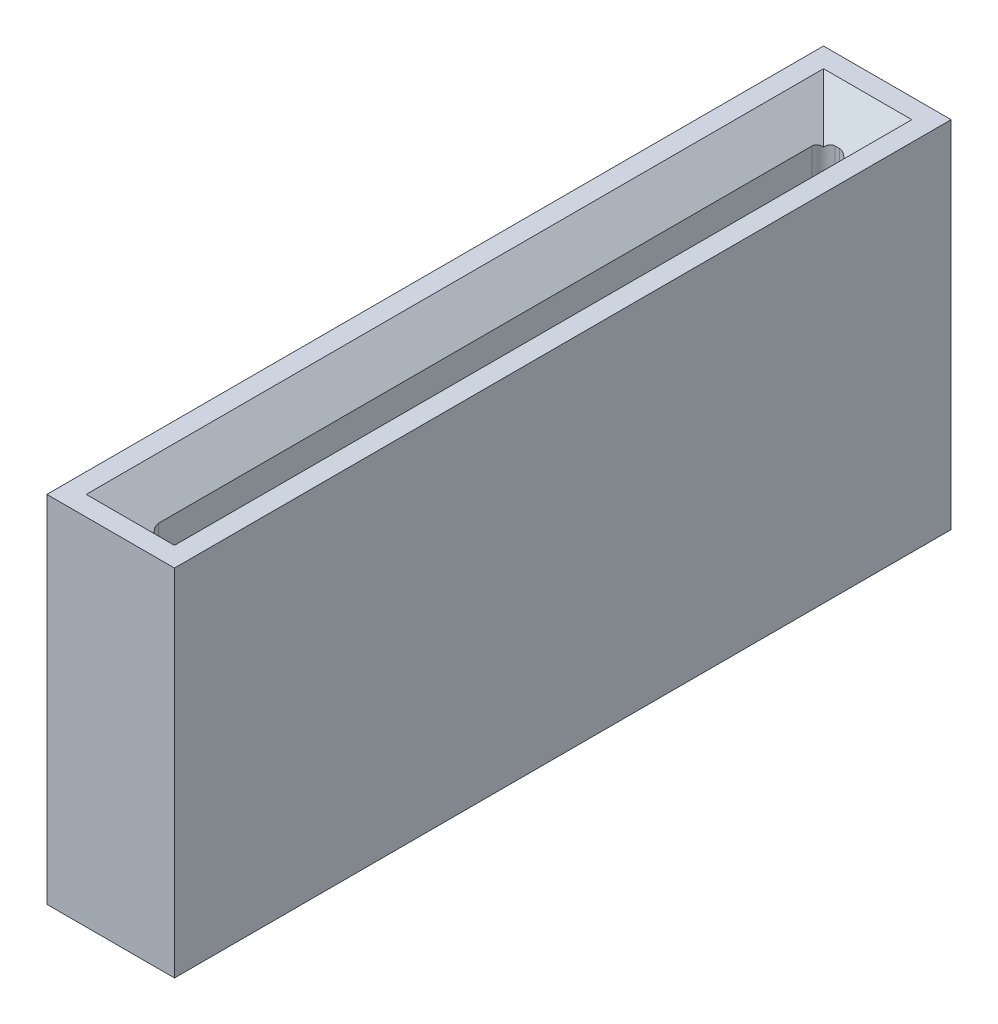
ISO-10303-21;
HEADER;
FILE_DESCRIPTION(('STEP AP214'),'2;1');
FILE_NAME('part.step','',(''),(''),'','','');
FILE_SCHEMA(('AUTOMOTIVE_DESIGN { 1 0 10303 214 1 1 1 1 }'));
ENDSEC;
DATA;
#1=APPLICATION_CONTEXT('core data for automotive mechanical design processes');
#2=APPLICATION_PROTOCOL_DEFINITION('international standard','automotive_design',2000,#1);
#3=PRODUCT_CONTEXT('',#1,'mechanical');
#4=PRODUCT('Part','Part','',(#3));
#5=PRODUCT_RELATED_PRODUCT_CATEGORY('part','',(#4));
#6=PRODUCT_DEFINITION_FORMATION('','',#4);
#7=PRODUCT_DEFINITION_CONTEXT('part definition',#1,'design');
#8=PRODUCT_DEFINITION('design','',#6,#7);
#9=PRODUCT_DEFINITION_SHAPE('','',#8);
#10=(LENGTH_UNIT() NAMED_UNIT(*) SI_UNIT(.MILLI.,.METRE.));
#11=(NAMED_UNIT(*) PLANE_ANGLE_UNIT() SI_UNIT($,.RADIAN.));
#12=(NAMED_UNIT(*) SI_UNIT($,.STERADIAN.) SOLID_ANGLE_UNIT());
#13=UNCERTAINTY_MEASURE_WITH_UNIT(LENGTH_MEASURE(1.E-05),#10,'distance_accuracy_value','');
#14=(GEOMETRIC_REPRESENTATION_CONTEXT(3) GLOBAL_UNCERTAINTY_ASSIGNED_CONTEXT((#13)) GLOBAL_UNIT_ASSIGNED_CONTEXT((#10,
#11,#12)) REPRESENTATION_CONTEXT('',''));
#15=CARTESIAN_POINT('',(0.,0.,0.));
#16=DIRECTION('',(0.,0.,1.));
#17=DIRECTION('',(1.,0.,0.));
#18=AXIS2_PLACEMENT_3D('',#15,#16,#17);
#19=CARTESIAN_POINT('',(0.,203.2,0.));
#20=DIRECTION('',(0.,1.,0.));
#21=DIRECTION('',(0.,0.,1.));
#22=AXIS2_PLACEMENT_3D('',#19,#20,#21);
#23=PLANE('',#22);
#24=DIRECTION('',(0.,0.,-1.));
#25=VECTOR('',#24,1.);
#26=CARTESIAN_POINT('',(-50.5250000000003,203.2,0.));
#27=LINE('',#26,#25);
#28=CARTESIAN_POINT('',(-50.5250000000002,203.2,422.));
#29=VERTEX_POINT('',#28);
#30=CARTESIAN_POINT('',(-50.5250000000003,203.2,-422.000000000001));
#31=VERTEX_POINT('',#30);
#32=EDGE_CURVE('E241',#29,#31,#27,.T.);
#33=ORIENTED_EDGE('',*,*,#32,.T.);
#34=DIRECTION('',(1.,0.,0.));
#35=VECTOR('',#34,1.);
#36=CARTESIAN_POINT('',(0.,203.2,-422.000000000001));
#37=LINE('',#36,#35);
#38=CARTESIAN_POINT('',(50.5250000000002,203.2,-422.000000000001));
#39=VERTEX_POINT('',#38);
#40=EDGE_CURVE('E250',#31,#39,#37,.T.);
#41=ORIENTED_EDGE('',*,*,#40,.T.);
#42=DIRECTION('',(0.,0.,1.));
#43=VECTOR('',#42,1.);
#44=CARTESIAN_POINT('',(50.5250000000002,203.2,0.));
#45=LINE('',#44,#43);
#46=CARTESIAN_POINT('',(50.5250000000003,203.2,422.));
#47=VERTEX_POINT('',#46);
#48=EDGE_CURVE('E249',#39,#47,#45,.T.);
#49=ORIENTED_EDGE('',*,*,#48,.T.);
#50=DIRECTION('',(-1.,0.,0.));
#51=VECTOR('',#50,1.);
#52=CARTESIAN_POINT('',(0.,203.2,422.));
#53=LINE('',#52,#51);
#54=EDGE_CURVE('E246',#47,#29,#53,.T.);
#55=ORIENTED_EDGE('',*,*,#54,.T.);
#56=EDGE_LOOP('',(#33,#41,#49,#55));
#57=FACE_BOUND('',#56,.T.);
#58=DIRECTION('',(1.,0.,0.));
#59=VECTOR('',#58,1.);
#60=CARTESIAN_POINT('',(-73.0249999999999,203.2,444.499999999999));
#61=LINE('',#60,#59);
#62=CARTESIAN_POINT('',(-73.0249999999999,203.2,444.499999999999));
#63=VERTEX_POINT('',#62);
#64=CARTESIAN_POINT('',(73.025,203.2,444.499999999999));
#65=VERTEX_POINT('',#64);
#66=EDGE_CURVE('E194',#63,#65,#61,.T.);
#67=ORIENTED_EDGE('',*,*,#66,.T.);
#68=DIRECTION('',(0.,0.,-1.));
#69=VECTOR('',#68,1.);
#70=CARTESIAN_POINT('',(73.025,203.2,444.499999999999));
#71=LINE('',#70,#69);
#72=CARTESIAN_POINT('',(73.0249999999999,203.2,-444.500000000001));
#73=VERTEX_POINT('',#72);
#74=EDGE_CURVE('E185',#65,#73,#71,.T.);
#75=ORIENTED_EDGE('',*,*,#74,.T.);
#76=DIRECTION('',(-1.,0.,0.));
#77=VECTOR('',#76,1.);
#78=CARTESIAN_POINT('',(73.0249999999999,203.2,-444.500000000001));
#79=LINE('',#78,#77);
#80=CARTESIAN_POINT('',(-73.0250000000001,203.2,-444.500000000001));
#81=VERTEX_POINT('',#80);
#82=EDGE_CURVE('E192',#73,#81,#79,.T.);
#83=ORIENTED_EDGE('',*,*,#82,.T.);
#84=DIRECTION('',(0.,0.,1.));
#85=VECTOR('',#84,1.);
#86=CARTESIAN_POINT('',(-73.0250000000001,203.2,-444.500000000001));
#87=LINE('',#86,#85);
#88=EDGE_CURVE('E197',#81,#63,#87,.T.);
#89=ORIENTED_EDGE('',*,*,#88,.T.);
#90=EDGE_LOOP('',(#67,#75,#83,#89));
#91=FACE_BOUND('',#90,.T.);
#92=ADVANCED_FACE('F42',(#57,#91),#23,.T.);
#93=CARTESIAN_POINT('',(0.,-203.2,0.));
#94=DIRECTION('',(0.,1.,0.));
#95=DIRECTION('',(0.,0.,1.));
#96=AXIS2_PLACEMENT_3D('',#93,#94,#95);
#97=PLANE('',#96);
#98=DIRECTION('',(0.,0.,1.));
#99=VECTOR('',#98,1.);
#100=CARTESIAN_POINT('',(-50.525,-203.2,386.999999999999));
#101=LINE('',#100,#99);
#102=CARTESIAN_POINT('',(-50.5250000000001,-203.2,-422.000000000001));
#103=VERTEX_POINT('',#102);
#104=CARTESIAN_POINT('',(-50.525,-203.2,421.999999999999));
#105=VERTEX_POINT('',#104);
#106=EDGE_CURVE('E214',#103,#105,#101,.T.);
#107=ORIENTED_EDGE('',*,*,#106,.T.);
#108=DIRECTION('',(1.,0.,0.));
#109=VECTOR('',#108,1.);
#110=CARTESIAN_POINT('',(15.525,-203.2,421.999999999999));
#111=LINE('',#110,#109);
#112=CARTESIAN_POINT('',(50.5250000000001,-203.2,421.999999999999));
#113=VERTEX_POINT('',#112);
#114=EDGE_CURVE('E220',#105,#113,#111,.T.);
#115=ORIENTED_EDGE('',*,*,#114,.T.);
#116=DIRECTION('',(0.,0.,-1.));
#117=VECTOR('',#116,1.);
#118=CARTESIAN_POINT('',(50.525,-203.2,-387.000000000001));
#119=LINE('',#118,#117);
#120=CARTESIAN_POINT('',(50.525,-203.2,-422.000000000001));
#121=VERTEX_POINT('',#120);
#122=EDGE_CURVE('E206',#113,#121,#119,.T.);
#123=ORIENTED_EDGE('',*,*,#122,.T.);
#124=DIRECTION('',(-1.,0.,0.));
#125=VECTOR('',#124,1.);
#126=CARTESIAN_POINT('',(-15.5250000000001,-203.2,-422.000000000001));
#127=LINE('',#126,#125);
#128=EDGE_CURVE('E208',#121,#103,#127,.T.);
#129=ORIENTED_EDGE('',*,*,#128,.T.);
#130=EDGE_LOOP('',(#107,#115,#123,#129));
#131=FACE_BOUND('',#130,.T.);
#132=DIRECTION('',(1.,0.,0.));
#133=VECTOR('',#132,1.);
#134=CARTESIAN_POINT('',(-73.0249999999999,-203.2,444.499999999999));
#135=LINE('',#134,#133);
#136=CARTESIAN_POINT('',(-73.0249999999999,-203.2,444.499999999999));
#137=VERTEX_POINT('',#136);
#138=CARTESIAN_POINT('',(73.025,-203.2,444.499999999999));
#139=VERTEX_POINT('',#138);
#140=EDGE_CURVE('E202',#137,#139,#135,.T.);
#141=ORIENTED_EDGE('',*,*,#140,.F.);
#142=DIRECTION('',(0.,0.,1.));
#143=VECTOR('',#142,1.);
#144=CARTESIAN_POINT('',(-73.0250000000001,-203.2,-444.500000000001));
#145=LINE('',#144,#143);
#146=CARTESIAN_POINT('',(-73.0250000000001,-203.2,-444.500000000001));
#147=VERTEX_POINT('',#146);
#148=EDGE_CURVE('E203',#147,#137,#145,.T.);
#149=ORIENTED_EDGE('',*,*,#148,.F.);
#150=DIRECTION('',(-1.,0.,0.));
#151=VECTOR('',#150,1.);
#152=CARTESIAN_POINT('',(73.0249999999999,-203.2,-444.500000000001));
#153=LINE('',#152,#151);
#154=CARTESIAN_POINT('',(73.0249999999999,-203.2,-444.500000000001));
#155=VERTEX_POINT('',#154);
#156=EDGE_CURVE('E397',#155,#147,#153,.T.);
#157=ORIENTED_EDGE('',*,*,#156,.F.);
#158=DIRECTION('',(0.,0.,-1.));
#159=VECTOR('',#158,1.);
#160=CARTESIAN_POINT('',(73.025,-203.2,444.499999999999));
#161=LINE('',#160,#159);
#162=EDGE_CURVE('E393',#139,#155,#161,.T.);
#163=ORIENTED_EDGE('',*,*,#162,.F.);
#164=EDGE_LOOP('',(#141,#149,#157,#163));
#165=FACE_BOUND('',#164,.T.);
#166=ADVANCED_FACE('F386',(#131,#165),#97,.F.);
#167=CARTESIAN_POINT('',(-73.0249999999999,203.2,444.499999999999));
#168=DIRECTION('',(0.,0.,-1.));
#169=DIRECTION('',(-1.,0.,0.));
#170=AXIS2_PLACEMENT_3D('',#167,#168,#169);
#171=PLANE('',#170);
#172=ORIENTED_EDGE('',*,*,#140,.T.);
#173=DIRECTION('',(0.,-1.,0.));
#174=VECTOR('',#173,1.);
#175=CARTESIAN_POINT('',(73.025,203.2,444.499999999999));
#176=LINE('',#175,#174);
#177=EDGE_CURVE('E187',#65,#139,#176,.T.);
#178=ORIENTED_EDGE('',*,*,#177,.F.);
#179=ORIENTED_EDGE('',*,*,#66,.F.);
#180=DIRECTION('',(0.,-1.,0.));
#181=VECTOR('',#180,1.);
#182=CARTESIAN_POINT('',(-73.0249999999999,203.2,444.499999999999));
#183=LINE('',#182,#181);
#184=EDGE_CURVE('E404',#63,#137,#183,.T.);
#185=ORIENTED_EDGE('',*,*,#184,.T.);
#186=EDGE_LOOP('',(#172,#178,#179,#185));
#187=FACE_BOUND('',#186,.T.);
#188=ADVANCED_FACE('F201',(#187),#171,.F.);
#189=CARTESIAN_POINT('',(73.025,203.2,444.499999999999));
#190=DIRECTION('',(-1.,0.,0.));
#191=DIRECTION('',(0.,0.,1.));
#192=AXIS2_PLACEMENT_3D('',#189,#190,#191);
#193=PLANE('',#192);
#194=ORIENTED_EDGE('',*,*,#162,.T.);
#195=DIRECTION('',(0.,-1.,0.));
#196=VECTOR('',#195,1.);
#197=CARTESIAN_POINT('',(73.0249999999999,203.2,-444.500000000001));
#198=LINE('',#197,#196);
#199=EDGE_CURVE('E186',#73,#155,#198,.T.);
#200=ORIENTED_EDGE('',*,*,#199,.F.);
#201=ORIENTED_EDGE('',*,*,#74,.F.);
#202=ORIENTED_EDGE('',*,*,#177,.T.);
#203=EDGE_LOOP('',(#194,#200,#201,#202));
#204=FACE_BOUND('',#203,.T.);
#205=ADVANCED_FACE('F184',(#204),#193,.F.);
#206=CARTESIAN_POINT('',(73.0249999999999,203.2,-444.500000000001));
#207=DIRECTION('',(0.,0.,1.));
#208=DIRECTION('',(1.,0.,0.));
#209=AXIS2_PLACEMENT_3D('',#206,#207,#208);
#210=PLANE('',#209);
#211=ORIENTED_EDGE('',*,*,#156,.T.);
#212=DIRECTION('',(0.,-1.,0.));
#213=VECTOR('',#212,1.);
#214=CARTESIAN_POINT('',(-73.0250000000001,203.2,-444.500000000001));
#215=LINE('',#214,#213);
#216=EDGE_CURVE('E209',#81,#147,#215,.T.);
#217=ORIENTED_EDGE('',*,*,#216,.F.);
#218=ORIENTED_EDGE('',*,*,#82,.F.);
#219=ORIENTED_EDGE('',*,*,#199,.T.);
#220=EDGE_LOOP('',(#211,#217,#218,#219));
#221=FACE_BOUND('',#220,.T.);
#222=ADVANCED_FACE('F408',(#221),#210,.F.);
#223=CARTESIAN_POINT('',(-73.0250000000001,203.2,-444.500000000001));
#224=DIRECTION('',(1.,0.,0.));
#225=DIRECTION('',(0.,0.,-1.));
#226=AXIS2_PLACEMENT_3D('',#223,#224,#225);
#227=PLANE('',#226);
#228=ORIENTED_EDGE('',*,*,#148,.T.);
#229=ORIENTED_EDGE('',*,*,#184,.F.);
#230=ORIENTED_EDGE('',*,*,#88,.F.);
#231=ORIENTED_EDGE('',*,*,#216,.T.);
#232=EDGE_LOOP('',(#228,#229,#230,#231));
#233=FACE_BOUND('',#232,.T.);
#234=ADVANCED_FACE('F410',(#233),#227,.F.);
#235=CARTESIAN_POINT('',(-15.525,203.2,386.999999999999));
#236=DIRECTION('',(0.,0.,-1.));
#237=DIRECTION('',(-1.,0.,0.));
#238=AXIS2_PLACEMENT_3D('',#235,#236,#237);
#239=PLANE('',#238);
#240=DIRECTION('',(-1.,0.,0.));
#241=VECTOR('',#240,1.);
#242=CARTESIAN_POINT('',(-15.525,-168.2,386.999999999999));
#243=LINE('',#242,#241);
#244=CARTESIAN_POINT('',(2.52500000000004,-168.2,386.999999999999));
#245=VERTEX_POINT('',#244);
#246=CARTESIAN_POINT('',(-2.52499999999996,-168.2,386.999999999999));
#247=VERTEX_POINT('',#246);
#248=EDGE_CURVE('E224',#245,#247,#243,.T.);
#249=ORIENTED_EDGE('',*,*,#248,.T.);
#250=DIRECTION('',(0.,-1.,0.));
#251=VECTOR('',#250,1.);
#252=CARTESIAN_POINT('',(-2.52499999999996,168.2,386.999999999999));
#253=LINE('',#252,#251);
#254=CARTESIAN_POINT('',(-2.52499999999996,168.2,386.999999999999));
#255=VERTEX_POINT('',#254);
#256=EDGE_CURVE('E280',#247,#255,#253,.F.);
#257=ORIENTED_EDGE('',*,*,#256,.T.);
#258=DIRECTION('',(1.,0.,0.));
#259=VECTOR('',#258,1.);
#260=CARTESIAN_POINT('',(-15.525,168.2,386.999999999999));
#261=LINE('',#260,#259);
#262=CARTESIAN_POINT('',(2.52500000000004,168.2,386.999999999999));
#263=VERTEX_POINT('',#262);
#264=EDGE_CURVE('E219',#255,#263,#261,.T.);
#265=ORIENTED_EDGE('',*,*,#264,.T.);
#266=DIRECTION('',(0.,-1.,0.));
#267=VECTOR('',#266,1.);
#268=CARTESIAN_POINT('',(2.52500000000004,-168.2,386.999999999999));
#269=LINE('',#268,#267);
#270=EDGE_CURVE('E273',#263,#245,#269,.T.);
#271=ORIENTED_EDGE('',*,*,#270,.T.);
#272=EDGE_LOOP('',(#249,#257,#265,#271));
#273=FACE_BOUND('',#272,.T.);
#274=ADVANCED_FACE('F382',(#273),#239,.T.);
#275=CARTESIAN_POINT('',(15.525,203.2,386.999999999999));
#276=DIRECTION('',(-1.,0.,0.));
#277=DIRECTION('',(0.,0.,1.));
#278=AXIS2_PLACEMENT_3D('',#275,#276,#277);
#279=PLANE('',#278);
#280=DIRECTION('',(0.,0.,1.));
#281=VECTOR('',#280,1.);
#282=CARTESIAN_POINT('',(15.525,-168.2,386.999999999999));
#283=LINE('',#282,#281);
#284=CARTESIAN_POINT('',(15.5249999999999,-168.2,-374.000000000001));
#285=VERTEX_POINT('',#284);
#286=CARTESIAN_POINT('',(15.525,-168.2,373.999999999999));
#287=VERTEX_POINT('',#286);
#288=EDGE_CURVE('E242',#285,#287,#283,.T.);
#289=ORIENTED_EDGE('',*,*,#288,.T.);
#290=DIRECTION('',(0.,-1.,0.));
#291=VECTOR('',#290,1.);
#292=CARTESIAN_POINT('',(15.525,168.2,373.999999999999));
#293=LINE('',#292,#291);
#294=CARTESIAN_POINT('',(15.525,168.2,373.999999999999));
#295=VERTEX_POINT('',#294);
#296=EDGE_CURVE('E284',#287,#295,#293,.F.);
#297=ORIENTED_EDGE('',*,*,#296,.T.);
#298=DIRECTION('',(0.,0.,-1.));
#299=VECTOR('',#298,1.);
#300=CARTESIAN_POINT('',(15.525,168.2,386.999999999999));
#301=LINE('',#300,#299);
#302=CARTESIAN_POINT('',(15.5249999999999,168.2,-374.000000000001));
#303=VERTEX_POINT('',#302);
#304=EDGE_CURVE('E236',#295,#303,#301,.T.);
#305=ORIENTED_EDGE('',*,*,#304,.T.);
#306=DIRECTION('',(0.,-1.,0.));
#307=VECTOR('',#306,1.);
#308=CARTESIAN_POINT('',(15.5249999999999,-168.2,-374.000000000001));
#309=LINE('',#308,#307);
#310=EDGE_CURVE('E276',#303,#285,#309,.T.);
#311=ORIENTED_EDGE('',*,*,#310,.T.);
#312=EDGE_LOOP('',(#289,#297,#305,#311));
#313=FACE_BOUND('',#312,.T.);
#314=ADVANCED_FACE('F373',(#313),#279,.T.);
#315=CARTESIAN_POINT('',(15.5249999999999,203.2,-387.000000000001));
#316=DIRECTION('',(0.,0.,1.));
#317=DIRECTION('',(1.,0.,0.));
#318=AXIS2_PLACEMENT_3D('',#315,#316,#317);
#319=PLANE('',#318);
#320=DIRECTION('',(1.,0.,0.));
#321=VECTOR('',#320,1.);
#322=CARTESIAN_POINT('',(15.5249999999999,-168.2,-387.000000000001));
#323=LINE('',#322,#321);
#324=CARTESIAN_POINT('',(-2.52500000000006,-168.2,-387.000000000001));
#325=VERTEX_POINT('',#324);
#326=CARTESIAN_POINT('',(2.52499999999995,-168.2,-387.000000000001));
#327=VERTEX_POINT('',#326);
#328=EDGE_CURVE('E235',#325,#327,#323,.T.);
#329=ORIENTED_EDGE('',*,*,#328,.T.);
#330=DIRECTION('',(0.,-1.,0.));
#331=VECTOR('',#330,1.);
#332=CARTESIAN_POINT('',(2.52499999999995,168.2,-387.000000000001));
#333=LINE('',#332,#331);
#334=CARTESIAN_POINT('',(2.52499999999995,168.2,-387.000000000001));
#335=VERTEX_POINT('',#334);
#336=EDGE_CURVE('E287',#327,#335,#333,.F.);
#337=ORIENTED_EDGE('',*,*,#336,.T.);
#338=DIRECTION('',(-1.,0.,0.));
#339=VECTOR('',#338,1.);
#340=CARTESIAN_POINT('',(15.5249999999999,168.2,-387.000000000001));
#341=LINE('',#340,#339);
#342=CARTESIAN_POINT('',(-2.52500000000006,168.2,-387.000000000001));
#343=VERTEX_POINT('',#342);
#344=EDGE_CURVE('E232',#335,#343,#341,.T.);
#345=ORIENTED_EDGE('',*,*,#344,.T.);
#346=DIRECTION('',(0.,-1.,0.));
#347=VECTOR('',#346,1.);
#348=CARTESIAN_POINT('',(-2.52500000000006,-168.2,-387.000000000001));
#349=LINE('',#348,#347);
#350=EDGE_CURVE('E281',#343,#325,#349,.T.);
#351=ORIENTED_EDGE('',*,*,#350,.T.);
#352=EDGE_LOOP('',(#329,#337,#345,#351));
#353=FACE_BOUND('',#352,.T.);
#354=ADVANCED_FACE('F333',(#353),#319,.T.);
#355=CARTESIAN_POINT('',(-15.5250000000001,203.2,-387.000000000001));
#356=DIRECTION('',(1.,0.,0.));
#357=DIRECTION('',(0.,0.,-1.));
#358=AXIS2_PLACEMENT_3D('',#355,#356,#357);
#359=PLANE('',#358);
#360=DIRECTION('',(0.,0.,1.));
#361=VECTOR('',#360,1.);
#362=CARTESIAN_POINT('',(-15.5250000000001,168.2,-387.000000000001));
#363=LINE('',#362,#361);
#364=CARTESIAN_POINT('',(-15.5250000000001,168.2,-374.000000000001));
#365=VERTEX_POINT('',#364);
#366=CARTESIAN_POINT('',(-15.525,168.2,373.999999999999));
#367=VERTEX_POINT('',#366);
#368=EDGE_CURVE('E227',#365,#367,#363,.T.);
#369=ORIENTED_EDGE('',*,*,#368,.T.);
#370=DIRECTION('',(0.,-1.,0.));
#371=VECTOR('',#370,1.);
#372=CARTESIAN_POINT('',(-15.525,-168.2,373.999999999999));
#373=LINE('',#372,#371);
#374=CARTESIAN_POINT('',(-15.525,-168.2,373.999999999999));
#375=VERTEX_POINT('',#374);
#376=EDGE_CURVE('E271',#367,#375,#373,.T.);
#377=ORIENTED_EDGE('',*,*,#376,.T.);
#378=DIRECTION('',(0.,0.,-1.));
#379=VECTOR('',#378,1.);
#380=CARTESIAN_POINT('',(-15.5250000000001,-168.2,-387.000000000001));
#381=LINE('',#380,#379);
#382=CARTESIAN_POINT('',(-15.5250000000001,-168.2,-374.000000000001));
#383=VERTEX_POINT('',#382);
#384=EDGE_CURVE('E226',#375,#383,#381,.T.);
#385=ORIENTED_EDGE('',*,*,#384,.T.);
#386=DIRECTION('',(0.,-1.,0.));
#387=VECTOR('',#386,1.);
#388=CARTESIAN_POINT('',(-15.5250000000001,168.2,-374.000000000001));
#389=LINE('',#388,#387);
#390=EDGE_CURVE('E251',#383,#365,#389,.F.);
#391=ORIENTED_EDGE('',*,*,#390,.T.);
#392=EDGE_LOOP('',(#369,#377,#385,#391));
#393=FACE_BOUND('',#392,.T.);
#394=ADVANCED_FACE('F363',(#393),#359,.T.);
#395=CARTESIAN_POINT('',(0.,-203.2,-422.000000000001));
#396=DIRECTION('',(0.,-0.707106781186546,0.707106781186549));
#397=DIRECTION('',(1.,0.,0.));
#398=AXIS2_PLACEMENT_3D('',#395,#396,#397);
#399=PLANE('',#398);
#400=DIRECTION('',(0.577350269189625,-0.577350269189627,-0.577350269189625));
#401=VECTOR('',#400,1.);
#402=CARTESIAN_POINT('',(33.6833333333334,-186.358333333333,-405.158333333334));
#403=LINE('',#402,#401);
#404=CARTESIAN_POINT('',(11.7173881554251,-164.392388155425,-383.192388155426));
#405=VERTEX_POINT('',#404);
#406=EDGE_CURVE('E259',#405,#121,#403,.T.);
#407=ORIENTED_EDGE('',*,*,#406,.F.);
#408=CARTESIAN_POINT('',(2.52499999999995,-155.2,-374.000000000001));
#409=DIRECTION('',(0.,-0.707106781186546,0.707106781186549));
#410=DIRECTION('',(0.,0.707106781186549,0.707106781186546));
#411=AXIS2_PLACEMENT_3D('',#408,#409,#410);
#412=ELLIPSE('',#411,18.3847763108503,13.);
#413=EDGE_CURVE('E315',#405,#327,#412,.F.);
#414=ORIENTED_EDGE('',*,*,#413,.T.);
#415=ORIENTED_EDGE('',*,*,#328,.F.);
#416=CARTESIAN_POINT('',(-2.52500000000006,-155.2,-374.000000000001));
#417=DIRECTION('',(0.,-0.707106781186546,0.707106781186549));
#418=DIRECTION('',(0.,0.707106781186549,0.707106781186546));
#419=AXIS2_PLACEMENT_3D('',#416,#417,#418);
#420=ELLIPSE('',#419,18.3847763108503,13.);
#421=CARTESIAN_POINT('',(-11.7173881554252,-164.392388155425,-383.192388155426));
#422=VERTEX_POINT('',#421);
#423=EDGE_CURVE('E317',#325,#422,#420,.F.);
#424=ORIENTED_EDGE('',*,*,#423,.T.);
#425=DIRECTION('',(-0.577350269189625,-0.577350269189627,-0.577350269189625));
#426=VECTOR('',#425,1.);
#427=CARTESIAN_POINT('',(90.1416666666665,-62.5333333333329,-281.333333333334));
#428=LINE('',#427,#426);
#429=EDGE_CURVE('E66',#103,#422,#428,.F.);
#430=ORIENTED_EDGE('',*,*,#429,.F.);
#431=ORIENTED_EDGE('',*,*,#128,.F.);
#432=EDGE_LOOP('',(#407,#414,#415,#424,#430,#431));
#433=FACE_BOUND('',#432,.T.);
#434=ADVANCED_FACE('F368',(#433),#399,.T.);
#435=CARTESIAN_POINT('',(-50.525,-203.2,0.));
#436=DIRECTION('',(0.707106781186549,-0.707106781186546,0.));
#437=DIRECTION('',(0.,0.,-1.));
#438=AXIS2_PLACEMENT_3D('',#435,#436,#437);
#439=PLANE('',#438);
#440=ORIENTED_EDGE('',*,*,#429,.T.);
#441=CARTESIAN_POINT('',(-2.52500000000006,-155.2,-374.000000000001));
#442=DIRECTION('',(0.707106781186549,-0.707106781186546,0.));
#443=DIRECTION('',(0.707106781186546,0.707106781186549,0.));
#444=AXIS2_PLACEMENT_3D('',#441,#442,#443);
#445=ELLIPSE('',#444,18.3847763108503,13.);
#446=EDGE_CURVE('E321',#422,#383,#445,.F.);
#447=ORIENTED_EDGE('',*,*,#446,.T.);
#448=ORIENTED_EDGE('',*,*,#384,.F.);
#449=CARTESIAN_POINT('',(-2.52499999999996,-155.2,373.999999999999));
#450=DIRECTION('',(0.707106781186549,-0.707106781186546,0.));
#451=DIRECTION('',(0.707106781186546,0.707106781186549,0.));
#452=AXIS2_PLACEMENT_3D('',#449,#450,#451);
#453=ELLIPSE('',#452,18.3847763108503,13.);
#454=CARTESIAN_POINT('',(-11.7173881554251,-164.392388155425,383.192388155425));
#455=VERTEX_POINT('',#454);
#456=EDGE_CURVE('E288',#375,#455,#453,.F.);
#457=ORIENTED_EDGE('',*,*,#456,.T.);
#458=DIRECTION('',(-0.577350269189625,-0.577350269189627,0.577350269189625));
#459=VECTOR('',#458,1.);
#460=CARTESIAN_POINT('',(-33.6833333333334,-186.358333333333,405.158333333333));
#461=LINE('',#460,#459);
#462=EDGE_CURVE('E258',#105,#455,#461,.F.);
#463=ORIENTED_EDGE('',*,*,#462,.F.);
#464=ORIENTED_EDGE('',*,*,#106,.F.);
#465=EDGE_LOOP('',(#440,#447,#448,#457,#463,#464));
#466=FACE_BOUND('',#465,.T.);
#467=ADVANCED_FACE('F362',(#466),#439,.T.);
#468=CARTESIAN_POINT('',(50.525,-203.2,0.));
#469=DIRECTION('',(-0.707106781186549,-0.707106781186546,0.));
#470=DIRECTION('',(0.,0.,1.));
#471=AXIS2_PLACEMENT_3D('',#468,#469,#470);
#472=PLANE('',#471);
#473=ORIENTED_EDGE('',*,*,#406,.T.);
#474=ORIENTED_EDGE('',*,*,#122,.F.);
#475=DIRECTION('',(-0.577350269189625,0.577350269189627,-0.577350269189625));
#476=VECTOR('',#475,1.);
#477=CARTESIAN_POINT('',(33.6833333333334,-186.358333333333,405.158333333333));
#478=LINE('',#477,#476);
#479=CARTESIAN_POINT('',(11.7173881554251,-164.392388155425,383.192388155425));
#480=VERTEX_POINT('',#479);
#481=EDGE_CURVE('E255',#480,#113,#478,.F.);
#482=ORIENTED_EDGE('',*,*,#481,.F.);
#483=CARTESIAN_POINT('',(2.52500000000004,-155.2,373.999999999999));
#484=DIRECTION('',(-0.707106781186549,-0.707106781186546,0.));
#485=DIRECTION('',(-0.707106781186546,0.707106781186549,0.));
#486=AXIS2_PLACEMENT_3D('',#483,#484,#485);
#487=ELLIPSE('',#486,18.3847763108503,13.);
#488=EDGE_CURVE('E302',#480,#287,#487,.F.);
#489=ORIENTED_EDGE('',*,*,#488,.T.);
#490=ORIENTED_EDGE('',*,*,#288,.F.);
#491=CARTESIAN_POINT('',(2.52499999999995,-155.2,-374.000000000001));
#492=DIRECTION('',(-0.707106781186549,-0.707106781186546,0.));
#493=DIRECTION('',(-0.707106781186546,0.707106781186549,0.));
#494=AXIS2_PLACEMENT_3D('',#491,#492,#493);
#495=ELLIPSE('',#494,18.3847763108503,13.);
#496=EDGE_CURVE('E310',#285,#405,#495,.F.);
#497=ORIENTED_EDGE('',*,*,#496,.T.);
#498=EDGE_LOOP('',(#473,#474,#482,#489,#490,#497));
#499=FACE_BOUND('',#498,.T.);
#500=ADVANCED_FACE('F371',(#499),#472,.T.);
#501=CARTESIAN_POINT('',(0.,-203.2,421.999999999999));
#502=DIRECTION('',(0.,-0.707106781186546,-0.707106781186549));
#503=DIRECTION('',(-1.,0.,0.));
#504=AXIS2_PLACEMENT_3D('',#501,#502,#503);
#505=PLANE('',#504);
#506=ORIENTED_EDGE('',*,*,#462,.T.);
#507=CARTESIAN_POINT('',(-2.52499999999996,-155.2,373.999999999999));
#508=DIRECTION('',(0.,-0.707106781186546,-0.707106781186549));
#509=DIRECTION('',(0.,0.707106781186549,-0.707106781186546));
#510=AXIS2_PLACEMENT_3D('',#507,#508,#509);
#511=ELLIPSE('',#510,18.3847763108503,13.);
#512=EDGE_CURVE('E295',#455,#247,#511,.F.);
#513=ORIENTED_EDGE('',*,*,#512,.T.);
#514=ORIENTED_EDGE('',*,*,#248,.F.);
#515=CARTESIAN_POINT('',(2.52500000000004,-155.2,373.999999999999));
#516=DIRECTION('',(0.,-0.707106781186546,-0.707106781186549));
#517=DIRECTION('',(0.,0.707106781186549,-0.707106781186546));
#518=AXIS2_PLACEMENT_3D('',#515,#516,#517);
#519=ELLIPSE('',#518,18.3847763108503,13.);
#520=EDGE_CURVE('E296',#245,#480,#519,.F.);
#521=ORIENTED_EDGE('',*,*,#520,.T.);
#522=ORIENTED_EDGE('',*,*,#481,.T.);
#523=ORIENTED_EDGE('',*,*,#114,.F.);
#524=EDGE_LOOP('',(#506,#513,#514,#521,#522,#523));
#525=FACE_BOUND('',#524,.T.);
#526=ADVANCED_FACE('F387',(#525),#505,.T.);
#527=CARTESIAN_POINT('',(-15.525,168.2,386.999999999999));
#528=DIRECTION('',(0.,-0.707106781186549,0.707106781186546));
#529=DIRECTION('',(1.,0.,0.));
#530=AXIS2_PLACEMENT_3D('',#527,#528,#529);
#531=PLANE('',#530);
#532=DIRECTION('',(0.577350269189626,-0.577350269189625,-0.577350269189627));
#533=VECTOR('',#532,1.);
#534=CARTESIAN_POINT('',(-15.525,168.2,386.999999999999));
#535=LINE('',#534,#533);
#536=CARTESIAN_POINT('',(-11.7173881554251,164.392388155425,383.192388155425));
#537=VERTEX_POINT('',#536);
#538=EDGE_CURVE('E266',#29,#537,#535,.T.);
#539=ORIENTED_EDGE('',*,*,#538,.F.);
#540=ORIENTED_EDGE('',*,*,#54,.F.);
#541=DIRECTION('',(-0.577350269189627,-0.577350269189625,-0.577350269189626));
#542=VECTOR('',#541,1.);
#543=CARTESIAN_POINT('',(15.525,168.2,386.999999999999));
#544=LINE('',#543,#542);
#545=CARTESIAN_POINT('',(11.7173881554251,164.392388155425,383.192388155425));
#546=VERTEX_POINT('',#545);
#547=EDGE_CURVE('E260',#546,#47,#544,.F.);
#548=ORIENTED_EDGE('',*,*,#547,.F.);
#549=CARTESIAN_POINT('',(2.52500000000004,155.2,373.999999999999));
#550=DIRECTION('',(0.,-0.707106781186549,0.707106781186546));
#551=DIRECTION('',(0.,0.707106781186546,0.707106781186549));
#552=AXIS2_PLACEMENT_3D('',#549,#550,#551);
#553=ELLIPSE('',#552,18.3847763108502,13.);
#554=EDGE_CURVE('E307',#546,#263,#553,.T.);
#555=ORIENTED_EDGE('',*,*,#554,.T.);
#556=ORIENTED_EDGE('',*,*,#264,.F.);
#557=CARTESIAN_POINT('',(-2.52499999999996,155.2,373.999999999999));
#558=DIRECTION('',(0.,-0.707106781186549,0.707106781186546));
#559=DIRECTION('',(0.,0.707106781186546,0.707106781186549));
#560=AXIS2_PLACEMENT_3D('',#557,#558,#559);
#561=ELLIPSE('',#560,18.3847763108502,13.);
#562=EDGE_CURVE('E294',#255,#537,#561,.T.);
#563=ORIENTED_EDGE('',*,*,#562,.T.);
#564=EDGE_LOOP('',(#539,#540,#548,#555,#556,#563));
#565=FACE_BOUND('',#564,.T.);
#566=ADVANCED_FACE('F355',(#565),#531,.F.);
#567=CARTESIAN_POINT('',(15.525,168.2,386.999999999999));
#568=DIRECTION('',(0.707106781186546,-0.707106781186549,0.));
#569=DIRECTION('',(0.,0.,-1.));
#570=AXIS2_PLACEMENT_3D('',#567,#568,#569);
#571=PLANE('',#570);
#572=ORIENTED_EDGE('',*,*,#547,.T.);
#573=ORIENTED_EDGE('',*,*,#48,.F.);
#574=DIRECTION('',(-0.577350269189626,-0.577350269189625,0.577350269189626));
#575=VECTOR('',#574,1.);
#576=CARTESIAN_POINT('',(15.5249999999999,168.2,-387.000000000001));
#577=LINE('',#576,#575);
#578=CARTESIAN_POINT('',(11.7173881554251,164.392388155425,-383.192388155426));
#579=VERTEX_POINT('',#578);
#580=EDGE_CURVE('E262',#579,#39,#577,.F.);
#581=ORIENTED_EDGE('',*,*,#580,.F.);
#582=CARTESIAN_POINT('',(2.52499999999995,155.2,-374.000000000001));
#583=DIRECTION('',(0.707106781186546,-0.707106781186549,0.));
#584=DIRECTION('',(0.707106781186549,0.707106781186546,0.));
#585=AXIS2_PLACEMENT_3D('',#582,#583,#584);
#586=ELLIPSE('',#585,18.3847763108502,13.);
#587=EDGE_CURVE('E320',#579,#303,#586,.T.);
#588=ORIENTED_EDGE('',*,*,#587,.T.);
#589=ORIENTED_EDGE('',*,*,#304,.F.);
#590=CARTESIAN_POINT('',(2.52500000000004,155.2,373.999999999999));
#591=DIRECTION('',(0.707106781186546,-0.707106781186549,0.));
#592=DIRECTION('',(0.707106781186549,0.707106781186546,0.));
#593=AXIS2_PLACEMENT_3D('',#590,#591,#592);
#594=ELLIPSE('',#593,18.3847763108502,13.);
#595=EDGE_CURVE('E303',#295,#546,#594,.T.);
#596=ORIENTED_EDGE('',*,*,#595,.T.);
#597=EDGE_LOOP('',(#572,#573,#581,#588,#589,#596));
#598=FACE_BOUND('',#597,.T.);
#599=ADVANCED_FACE('F345',(#598),#571,.F.);
#600=CARTESIAN_POINT('',(-15.5250000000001,168.2,-387.000000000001));
#601=DIRECTION('',(-0.707106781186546,-0.707106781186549,0.));
#602=DIRECTION('',(0.,0.,1.));
#603=AXIS2_PLACEMENT_3D('',#600,#601,#602);
#604=PLANE('',#603);
#605=ORIENTED_EDGE('',*,*,#538,.T.);
#606=CARTESIAN_POINT('',(-2.52499999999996,155.2,373.999999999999));
#607=DIRECTION('',(-0.707106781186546,-0.707106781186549,0.));
#608=DIRECTION('',(-0.707106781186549,0.707106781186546,0.));
#609=AXIS2_PLACEMENT_3D('',#606,#607,#608);
#610=ELLIPSE('',#609,18.3847763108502,13.);
#611=EDGE_CURVE('E299',#537,#367,#610,.T.);
#612=ORIENTED_EDGE('',*,*,#611,.T.);
#613=ORIENTED_EDGE('',*,*,#368,.F.);
#614=CARTESIAN_POINT('',(-2.52500000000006,155.2,-374.000000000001));
#615=DIRECTION('',(-0.707106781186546,-0.707106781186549,0.));
#616=DIRECTION('',(-0.707106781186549,0.707106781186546,0.));
#617=AXIS2_PLACEMENT_3D('',#614,#615,#616);
#618=ELLIPSE('',#617,18.3847763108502,13.);
#619=CARTESIAN_POINT('',(-11.7173881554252,164.392388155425,-383.192388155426));
#620=VERTEX_POINT('',#619);
#621=EDGE_CURVE('E55',#365,#620,#618,.T.);
#622=ORIENTED_EDGE('',*,*,#621,.T.);
#623=DIRECTION('',(-0.577350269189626,0.577350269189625,-0.577350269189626));
#624=VECTOR('',#623,1.);
#625=CARTESIAN_POINT('',(-5.17500000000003,157.85,-376.650000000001));
#626=LINE('',#625,#624);
#627=EDGE_CURVE('E59',#31,#620,#626,.F.);
#628=ORIENTED_EDGE('',*,*,#627,.F.);
#629=ORIENTED_EDGE('',*,*,#32,.F.);
#630=EDGE_LOOP('',(#605,#612,#613,#622,#628,#629));
#631=FACE_BOUND('',#630,.T.);
#632=ADVANCED_FACE('F326',(#631),#604,.F.);
#633=CARTESIAN_POINT('',(15.5249999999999,168.2,-387.000000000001));
#634=DIRECTION('',(0.,-0.707106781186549,-0.707106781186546));
#635=DIRECTION('',(-1.,0.,0.));
#636=AXIS2_PLACEMENT_3D('',#633,#634,#635);
#637=PLANE('',#636);
#638=ORIENTED_EDGE('',*,*,#580,.T.);
#639=ORIENTED_EDGE('',*,*,#40,.F.);
#640=ORIENTED_EDGE('',*,*,#627,.T.);
#641=CARTESIAN_POINT('',(-2.52500000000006,155.2,-374.000000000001));
#642=DIRECTION('',(0.,-0.707106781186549,-0.707106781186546));
#643=DIRECTION('',(0.,0.707106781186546,-0.707106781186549));
#644=AXIS2_PLACEMENT_3D('',#641,#642,#643);
#645=ELLIPSE('',#644,18.3847763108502,13.);
#646=EDGE_CURVE('E11',#620,#343,#645,.T.);
#647=ORIENTED_EDGE('',*,*,#646,.T.);
#648=ORIENTED_EDGE('',*,*,#344,.F.);
#649=CARTESIAN_POINT('',(2.52499999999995,155.2,-374.000000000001));
#650=DIRECTION('',(0.,-0.707106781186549,-0.707106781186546));
#651=DIRECTION('',(0.,0.707106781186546,-0.707106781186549));
#652=AXIS2_PLACEMENT_3D('',#649,#650,#651);
#653=ELLIPSE('',#652,18.3847763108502,13.);
#654=EDGE_CURVE('E314',#335,#579,#653,.T.);
#655=ORIENTED_EDGE('',*,*,#654,.T.);
#656=EDGE_LOOP('',(#638,#639,#640,#647,#648,#655));
#657=FACE_BOUND('',#656,.T.);
#658=ADVANCED_FACE('F335',(#657),#637,.F.);
#659=CARTESIAN_POINT('',(-2.52499999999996,203.2,373.999999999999));
#660=DIRECTION('',(0.,1.,0.));
#661=DIRECTION('',(0.,0.,1.));
#662=AXIS2_PLACEMENT_3D('',#659,#660,#661);
#663=CYLINDRICAL_SURFACE('',#662,13.);
#664=ORIENTED_EDGE('',*,*,#562,.F.);
#665=ORIENTED_EDGE('',*,*,#256,.F.);
#666=ORIENTED_EDGE('',*,*,#512,.F.);
#667=ORIENTED_EDGE('',*,*,#456,.F.);
#668=ORIENTED_EDGE('',*,*,#376,.F.);
#669=ORIENTED_EDGE('',*,*,#611,.F.);
#670=EDGE_LOOP('',(#664,#665,#666,#667,#668,#669));
#671=FACE_BOUND('',#670,.T.);
#672=ADVANCED_FACE('F357',(#671),#663,.F.);
#673=CARTESIAN_POINT('',(2.52500000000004,203.2,373.999999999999));
#674=DIRECTION('',(0.,1.,0.));
#675=DIRECTION('',(0.,0.,1.));
#676=AXIS2_PLACEMENT_3D('',#673,#674,#675);
#677=CYLINDRICAL_SURFACE('',#676,13.);
#678=ORIENTED_EDGE('',*,*,#595,.F.);
#679=ORIENTED_EDGE('',*,*,#296,.F.);
#680=ORIENTED_EDGE('',*,*,#488,.F.);
#681=ORIENTED_EDGE('',*,*,#520,.F.);
#682=ORIENTED_EDGE('',*,*,#270,.F.);
#683=ORIENTED_EDGE('',*,*,#554,.F.);
#684=EDGE_LOOP('',(#678,#679,#680,#681,#682,#683));
#685=FACE_BOUND('',#684,.T.);
#686=ADVANCED_FACE('F377',(#685),#677,.F.);
#687=CARTESIAN_POINT('',(2.52499999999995,203.2,-374.000000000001));
#688=DIRECTION('',(0.,1.,0.));
#689=DIRECTION('',(0.,0.,1.));
#690=AXIS2_PLACEMENT_3D('',#687,#688,#689);
#691=CYLINDRICAL_SURFACE('',#690,13.);
#692=ORIENTED_EDGE('',*,*,#654,.F.);
#693=ORIENTED_EDGE('',*,*,#336,.F.);
#694=ORIENTED_EDGE('',*,*,#413,.F.);
#695=ORIENTED_EDGE('',*,*,#496,.F.);
#696=ORIENTED_EDGE('',*,*,#310,.F.);
#697=ORIENTED_EDGE('',*,*,#587,.F.);
#698=EDGE_LOOP('',(#692,#693,#694,#695,#696,#697));
#699=FACE_BOUND('',#698,.T.);
#700=ADVANCED_FACE('F338',(#699),#691,.F.);
#701=CARTESIAN_POINT('',(-2.52500000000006,203.2,-374.000000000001));
#702=DIRECTION('',(0.,1.,0.));
#703=DIRECTION('',(0.,0.,1.));
#704=AXIS2_PLACEMENT_3D('',#701,#702,#703);
#705=CYLINDRICAL_SURFACE('',#704,13.);
#706=ORIENTED_EDGE('',*,*,#621,.F.);
#707=ORIENTED_EDGE('',*,*,#390,.F.);
#708=ORIENTED_EDGE('',*,*,#446,.F.);
#709=ORIENTED_EDGE('',*,*,#423,.F.);
#710=ORIENTED_EDGE('',*,*,#350,.F.);
#711=ORIENTED_EDGE('',*,*,#646,.F.);
#712=EDGE_LOOP('',(#706,#707,#708,#709,#710,#711));
#713=FACE_BOUND('',#712,.T.);
#714=ADVANCED_FACE('F46',(#713),#705,.F.);
#715=CLOSED_SHELL('',(#92,#166,#188,#205,#222,#234,#274,#314,#354,#394,#434,#467,#500,#526,#566,
#599,#632,#658,#672,#686,#700,#714));
#716=MANIFOLD_SOLID_BREP('B2',#715);
#717=ADVANCED_BREP_SHAPE_REPRESENTATION('',(#18,#716),#14);
#718=SHAPE_DEFINITION_REPRESENTATION(#9,#717);
ENDSEC;
END-ISO-10303-21;
